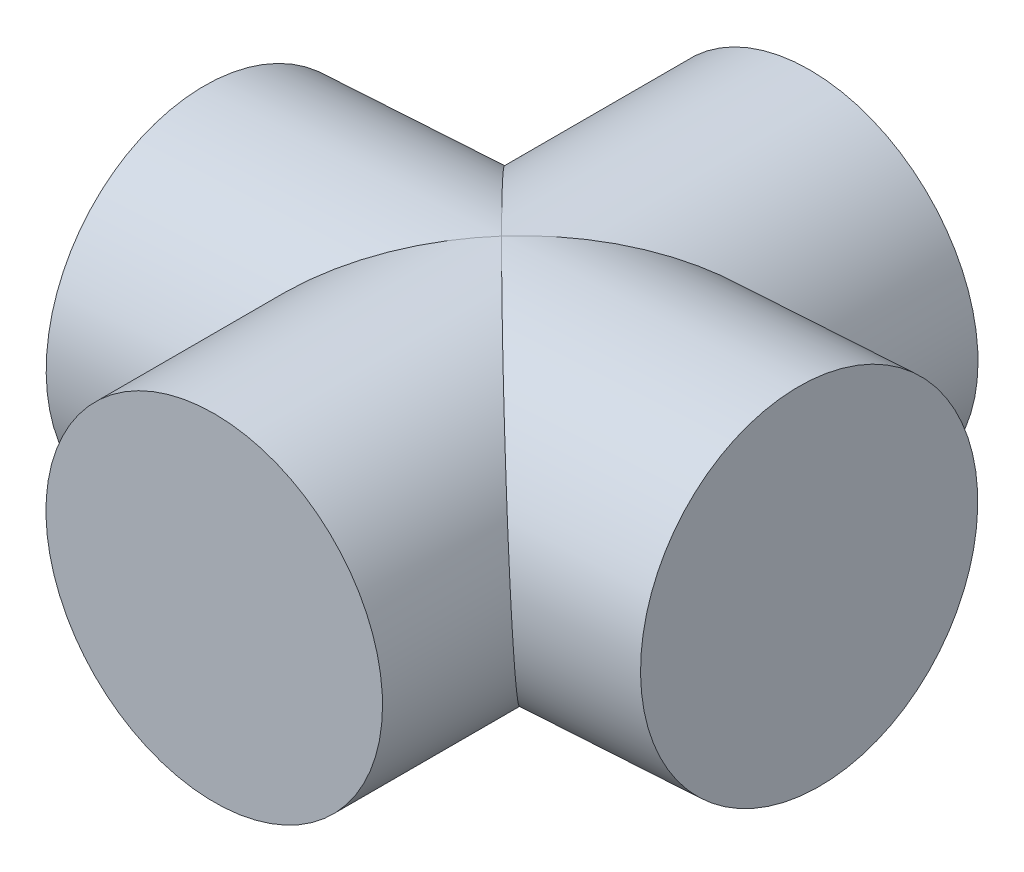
ISO-10303-21;
HEADER;
FILE_DESCRIPTION(('STEP AP214'),'2;1');
FILE_NAME('part.step','',(''),(''),'','','');
FILE_SCHEMA(('AUTOMOTIVE_DESIGN { 1 0 10303 214 1 1 1 1 }'));
ENDSEC;
DATA;
#1=APPLICATION_CONTEXT('core data for automotive mechanical design processes');
#2=APPLICATION_PROTOCOL_DEFINITION('international standard','automotive_design',2000,#1);
#3=PRODUCT_CONTEXT('',#1,'mechanical');
#4=PRODUCT('Part','Part','',(#3));
#5=PRODUCT_RELATED_PRODUCT_CATEGORY('part','',(#4));
#6=PRODUCT_DEFINITION_FORMATION('','',#4);
#7=PRODUCT_DEFINITION_CONTEXT('part definition',#1,'design');
#8=PRODUCT_DEFINITION('design','',#6,#7);
#9=PRODUCT_DEFINITION_SHAPE('','',#8);
#10=(LENGTH_UNIT() NAMED_UNIT(*) SI_UNIT(.MILLI.,.METRE.));
#11=(NAMED_UNIT(*) PLANE_ANGLE_UNIT() SI_UNIT($,.RADIAN.));
#12=(NAMED_UNIT(*) SI_UNIT($,.STERADIAN.) SOLID_ANGLE_UNIT());
#13=UNCERTAINTY_MEASURE_WITH_UNIT(LENGTH_MEASURE(1.E-05),#10,'distance_accuracy_value','');
#14=(GEOMETRIC_REPRESENTATION_CONTEXT(3) GLOBAL_UNCERTAINTY_ASSIGNED_CONTEXT((#13)) GLOBAL_UNIT_ASSIGNED_CONTEXT((#10,
#11,#12)) REPRESENTATION_CONTEXT('',''));
#15=CARTESIAN_POINT('',(0.,0.,0.));
#16=DIRECTION('',(0.,0.,1.));
#17=DIRECTION('',(1.,0.,0.));
#18=AXIS2_PLACEMENT_3D('',#15,#16,#17);
#19=CARTESIAN_POINT('',(-44.993112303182,-44.3,-62.6231110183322));
#20=DIRECTION('',(-7.07976677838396E-08,0.,0.999999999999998));
#21=DIRECTION('',(0.998097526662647,0.0616549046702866,7.06629771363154E-08));
#22=AXIS2_PLACEMENT_3D('',#19,#20,#21);
#23=CYLINDRICAL_SURFACE('',#22,6.5);
#24=DIRECTION('',(-7.07976677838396E-08,0.,0.999999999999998));
#25=VECTOR('',#24,1.);
#26=CARTESIAN_POINT('',(-38.5054783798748,-43.8992431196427,-62.6231105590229));
#27=LINE('',#26,#25);
#28=CARTESIAN_POINT('',(-38.5054783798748,-43.8992431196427,-62.6231105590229));
#29=VERTEX_POINT('',#28);
#30=CARTESIAN_POINT('',(-38.505478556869,-43.8992431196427,-60.1231105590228));
#31=VERTEX_POINT('',#30);
#32=EDGE_CURVE('E95',#29,#31,#27,.T.);
#33=ORIENTED_EDGE('',*,*,#32,.F.);
#34=ORIENTED_EDGE('',*,*,#32,.T.);
#35=CARTESIAN_POINT('',(-44.5923560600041,-50.7876339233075,-53.6231109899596));
#36=CARTESIAN_POINT('',(-40.7919878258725,-50.5528759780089,-57.4307225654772));
#37=CARTESIAN_POINT('',(-38.2707206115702,-47.6996110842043,-60.1231105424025));
#38=CARTESIAN_POINT('',(-38.505478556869,-43.8992431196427,-60.1231105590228));
#39=(BOUNDED_CURVE() B_SPLINE_CURVE(3,(#35,#36,#37,#38),.UNSPECIFIED.,.F.,
.F.) B_SPLINE_CURVE_WITH_KNOTS((4,4),(1.5707963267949,3.1415926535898),
.UNSPECIFIED.) CURVE() GEOMETRIC_REPRESENTATION_ITEM() RATIONAL_B_SPLINE_CURVE((1.,
0.804737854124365,0.804737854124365,1.)) REPRESENTATION_ITEM(''));
#40=CARTESIAN_POINT('',(-44.5923560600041,-50.7876339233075,-53.6231109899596));
#41=VERTEX_POINT('',#40);
#42=EDGE_CURVE('E87',#41,#31,#39,.T.);
#43=ORIENTED_EDGE('',*,*,#42,.F.);
#44=CARTESIAN_POINT('',(-51.4807464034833,-44.7007568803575,-60.1231114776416));
#45=CARTESIAN_POINT('',(-51.2459884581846,-48.5011248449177,-60.1231114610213));
#46=CARTESIAN_POINT('',(-48.3927237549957,-51.0223918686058,-57.4307231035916));
#47=CARTESIAN_POINT('',(-44.5923560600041,-50.7876339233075,-53.6231109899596));
#48=(BOUNDED_CURVE() B_SPLINE_CURVE(3,(#44,#45,#46,#47),.UNSPECIFIED.,.F.,
.F.) B_SPLINE_CURVE_WITH_KNOTS((4,4),(3.1415926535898,4.71238898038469),
.UNSPECIFIED.) CURVE() GEOMETRIC_REPRESENTATION_ITEM() RATIONAL_B_SPLINE_CURVE((1.,
0.804737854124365,0.804737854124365,1.)) REPRESENTATION_ITEM(''));
#49=CARTESIAN_POINT('',(-51.4807464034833,-44.7007568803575,-60.1231114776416));
#50=VERTEX_POINT('',#49);
#51=EDGE_CURVE('E66',#50,#41,#48,.T.);
#52=ORIENTED_EDGE('',*,*,#51,.F.);
#53=DIRECTION('',(-7.07976677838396E-08,0.,0.999999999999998));
#54=VECTOR('',#53,1.);
#55=CARTESIAN_POINT('',(-51.4807462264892,-44.7007568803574,-62.6231114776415));
#56=LINE('',#55,#54);
#57=CARTESIAN_POINT('',(-51.4807462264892,-44.7007568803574,-62.6231114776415));
#58=VERTEX_POINT('',#57);
#59=EDGE_CURVE('E101',#58,#50,#56,.T.);
#60=ORIENTED_EDGE('',*,*,#59,.F.);
#61=ORIENTED_EDGE('',*,*,#59,.T.);
#62=CARTESIAN_POINT('',(-45.3938698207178,-37.8123660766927,-53.6231110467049));
#63=CARTESIAN_POINT('',(-49.1942375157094,-38.0471240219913,-57.430723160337));
#64=CARTESIAN_POINT('',(-51.7155043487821,-40.9003889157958,-60.1231114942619));
#65=CARTESIAN_POINT('',(-51.4807464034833,-44.7007568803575,-60.1231114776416));
#66=(BOUNDED_CURVE() B_SPLINE_CURVE(3,(#62,#63,#64,#65),.UNSPECIFIED.,.F.,
.F.) B_SPLINE_CURVE_WITH_KNOTS((4,4),(1.5707963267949,3.1415926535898),
.UNSPECIFIED.) CURVE() GEOMETRIC_REPRESENTATION_ITEM() RATIONAL_B_SPLINE_CURVE((1.,
0.804737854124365,0.804737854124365,1.)) REPRESENTATION_ITEM(''));
#67=CARTESIAN_POINT('',(-45.3938698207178,-37.8123660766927,-53.6231110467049));
#68=VERTEX_POINT('',#67);
#69=EDGE_CURVE('E82',#68,#50,#66,.T.);
#70=ORIENTED_EDGE('',*,*,#69,.F.);
#71=CARTESIAN_POINT('',(-38.505478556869,-43.8992431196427,-60.1231105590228));
#72=CARTESIAN_POINT('',(-38.7402365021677,-40.0988751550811,-60.1231105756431));
#73=CARTESIAN_POINT('',(-41.5935015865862,-37.5776081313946,-57.4307226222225));
#74=CARTESIAN_POINT('',(-45.3938698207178,-37.8123660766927,-53.6231110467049));
#75=(BOUNDED_CURVE() B_SPLINE_CURVE(3,(#71,#72,#73,#74),.UNSPECIFIED.,.F.,
.F.) B_SPLINE_CURVE_WITH_KNOTS((4,4),(3.1415926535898,4.71238898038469),
.UNSPECIFIED.) CURVE() GEOMETRIC_REPRESENTATION_ITEM() RATIONAL_B_SPLINE_CURVE((1.,
0.804737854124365,0.804737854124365,1.)) REPRESENTATION_ITEM(''));
#76=EDGE_CURVE('E104',#31,#68,#75,.T.);
#77=ORIENTED_EDGE('',*,*,#76,.F.);
#78=EDGE_LOOP('',(#33,#34,#43,#52,#60,#61,#70,#77));
#79=FACE_BOUND('',#78,.T.);
#80=CARTESIAN_POINT('',(-44.9931121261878,-44.3000000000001,-65.1231110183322));
#81=DIRECTION('',(-7.07976677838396E-08,0.,0.999999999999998));
#82=DIRECTION('',(0.999972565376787,-0.00740732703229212,7.07957255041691E-08));
#83=AXIS2_PLACEMENT_3D('',#80,#81,#82);
#84=CIRCLE('',#83,6.5);
#85=CARTESIAN_POINT('',(-38.4932904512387,-44.34814762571,-65.12311055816));
#86=VERTEX_POINT('',#85);
#87=EDGE_CURVE('E110',#86,#86,#84,.T.);
#88=ORIENTED_EDGE('',*,*,#87,.T.);
#89=EDGE_LOOP('',(#88));
#90=FACE_BOUND('',#89,.T.);
#91=ADVANCED_FACE('F16',(#79,#90),#23,.T.);
#92=CARTESIAN_POINT('',(-36.0102352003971,-43.7451058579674,-53.6231103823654));
#93=DIRECTION('',(-0.998097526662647,-0.0616549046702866,-7.0662980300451E-08));
#94=DIRECTION('',(-7.07976713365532E-08,0.,0.999999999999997));
#95=AXIS2_PLACEMENT_3D('',#92,#93,#94);
#96=CYLINDRICAL_SURFACE('',#95,6.5);
#97=ORIENTED_EDGE('',*,*,#69,.T.);
#98=DIRECTION('',(-0.998097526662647,-0.0616549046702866,-7.0662980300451E-08));
#99=VECTOR('',#98,1.);
#100=CARTESIAN_POINT('',(-36.0102347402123,-43.7451058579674,-60.1231103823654));
#101=LINE('',#100,#99);
#102=CARTESIAN_POINT('',(-53.97599022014,-44.8548941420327,-60.123111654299));
#103=VERTEX_POINT('',#102);
#104=EDGE_CURVE('E20',#50,#103,#101,.T.);
#105=ORIENTED_EDGE('',*,*,#104,.T.);
#106=ORIENTED_EDGE('',*,*,#104,.F.);
#107=ORIENTED_EDGE('',*,*,#51,.T.);
#108=CARTESIAN_POINT('',(-44.5923560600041,-50.7876339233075,-53.6231109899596));
#109=CARTESIAN_POINT('',(-48.3927242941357,-51.0223918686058,-49.8154994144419));
#110=CARTESIAN_POINT('',(-51.2459893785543,-48.5011248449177,-47.1231114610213));
#111=CARTESIAN_POINT('',(-51.480747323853,-44.7007568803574,-47.1231114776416));
#112=(BOUNDED_CURVE() B_SPLINE_CURVE(3,(#108,#109,#110,#111),.UNSPECIFIED.,.F.,
.F.) B_SPLINE_CURVE_WITH_KNOTS((4,4),(4.71238898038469,6.28318530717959),
.UNSPECIFIED.) CURVE() GEOMETRIC_REPRESENTATION_ITEM() RATIONAL_B_SPLINE_CURVE((1.,
0.804737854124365,0.804737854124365,1.)) REPRESENTATION_ITEM(''));
#113=CARTESIAN_POINT('',(-51.480747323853,-44.7007568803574,-47.1231114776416));
#114=VERTEX_POINT('',#113);
#115=EDGE_CURVE('E27',#41,#114,#112,.T.);
#116=ORIENTED_EDGE('',*,*,#115,.T.);
#117=DIRECTION('',(-0.998097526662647,-0.0616549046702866,-7.0662980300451E-08));
#118=VECTOR('',#117,1.);
#119=CARTESIAN_POINT('',(-36.010235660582,-43.7451058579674,-47.1231103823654));
#120=LINE('',#119,#118);
#121=CARTESIAN_POINT('',(-53.9759911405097,-44.8548941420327,-47.1231116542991));
#122=VERTEX_POINT('',#121);
#123=EDGE_CURVE('E147',#114,#122,#120,.T.);
#124=ORIENTED_EDGE('',*,*,#123,.T.);
#125=ORIENTED_EDGE('',*,*,#123,.F.);
#126=CARTESIAN_POINT('',(-51.480747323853,-44.7007568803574,-47.1231114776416));
#127=CARTESIAN_POINT('',(-51.7155052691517,-40.9003889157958,-47.123111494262));
#128=CARTESIAN_POINT('',(-49.1942380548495,-38.0471240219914,-49.8154994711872));
#129=CARTESIAN_POINT('',(-45.3938698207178,-37.8123660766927,-53.6231110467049));
#130=(BOUNDED_CURVE() B_SPLINE_CURVE(3,(#126,#127,#128,#129),.UNSPECIFIED.,.F.,
.F.) B_SPLINE_CURVE_WITH_KNOTS((4,4),(0.,1.5707963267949),
.UNSPECIFIED.) CURVE() GEOMETRIC_REPRESENTATION_ITEM() RATIONAL_B_SPLINE_CURVE((1.,
0.804737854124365,0.804737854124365,1.)) REPRESENTATION_ITEM(''));
#131=EDGE_CURVE('E145',#114,#68,#130,.T.);
#132=ORIENTED_EDGE('',*,*,#131,.T.);
#133=EDGE_LOOP('',(#97,#105,#106,#107,#116,#124,#125,#132));
#134=FACE_BOUND('',#133,.T.);
#135=CARTESIAN_POINT('',(-56.4712344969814,-45.0090314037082,-53.6231118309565));
#136=DIRECTION('',(0.998097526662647,0.0616549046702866,7.0662980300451E-08));
#137=DIRECTION('',(7.07976713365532E-08,0.,-0.999999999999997));
#138=AXIS2_PLACEMENT_3D('',#135,#136,#137);
#139=CIRCLE('',#138,6.5);
#140=CARTESIAN_POINT('',(-56.4712340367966,-45.0090314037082,-60.1231118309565));
#141=VERTEX_POINT('',#140);
#142=EDGE_CURVE('E188',#141,#141,#139,.T.);
#143=ORIENTED_EDGE('',*,*,#142,.T.);
#144=EDGE_LOOP('',(#143));
#145=FACE_BOUND('',#144,.T.);
#146=ADVANCED_FACE('F18',(#134,#145),#96,.T.);
#147=CARTESIAN_POINT('',(-44.993112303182,-44.3,-62.6231110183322));
#148=DIRECTION('',(-7.07976677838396E-08,0.,0.999999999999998));
#149=DIRECTION('',(0.998097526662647,0.0616549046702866,7.06629771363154E-08));
#150=AXIS2_PLACEMENT_3D('',#147,#148,#149);
#151=CYLINDRICAL_SURFACE('',#150,6.5);
#152=ORIENTED_EDGE('',*,*,#131,.F.);
#153=DIRECTION('',(-7.07976677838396E-08,0.,0.999999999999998));
#154=VECTOR('',#153,1.);
#155=CARTESIAN_POINT('',(-51.4807462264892,-44.7007568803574,-62.6231114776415));
#156=LINE('',#155,#154);
#157=CARTESIAN_POINT('',(-51.4807475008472,-44.7007568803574,-44.6231114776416));
#158=VERTEX_POINT('',#157);
#159=EDGE_CURVE('E173',#114,#158,#156,.T.);
#160=ORIENTED_EDGE('',*,*,#159,.T.);
#161=ORIENTED_EDGE('',*,*,#159,.F.);
#162=ORIENTED_EDGE('',*,*,#115,.F.);
#163=CARTESIAN_POINT('',(-38.5054794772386,-43.8992431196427,-47.1231105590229));
#164=CARTESIAN_POINT('',(-38.2707215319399,-47.6996110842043,-47.1231105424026));
#165=CARTESIAN_POINT('',(-40.7919883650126,-50.5528759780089,-49.8154988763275));
#166=CARTESIAN_POINT('',(-44.5923560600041,-50.7876339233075,-53.6231109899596));
#167=(BOUNDED_CURVE() B_SPLINE_CURVE(3,(#163,#164,#165,#166),.UNSPECIFIED.,.F.,
.F.) B_SPLINE_CURVE_WITH_KNOTS((4,4),(0.,1.5707963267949),
.UNSPECIFIED.) CURVE() GEOMETRIC_REPRESENTATION_ITEM() RATIONAL_B_SPLINE_CURVE((1.,
0.804737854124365,0.804737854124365,1.)) REPRESENTATION_ITEM(''));
#168=CARTESIAN_POINT('',(-38.5054794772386,-43.8992431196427,-47.1231105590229));
#169=VERTEX_POINT('',#168);
#170=EDGE_CURVE('E10',#169,#41,#167,.T.);
#171=ORIENTED_EDGE('',*,*,#170,.F.);
#172=DIRECTION('',(-7.07976677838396E-08,0.,0.999999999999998));
#173=VECTOR('',#172,1.);
#174=CARTESIAN_POINT('',(-38.5054783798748,-43.8992431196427,-62.6231105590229));
#175=LINE('',#174,#173);
#176=CARTESIAN_POINT('',(-38.5054796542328,-43.8992431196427,-44.6231105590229));
#177=VERTEX_POINT('',#176);
#178=EDGE_CURVE('E56',#169,#177,#175,.T.);
#179=ORIENTED_EDGE('',*,*,#178,.T.);
#180=ORIENTED_EDGE('',*,*,#178,.F.);
#181=CARTESIAN_POINT('',(-45.3938698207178,-37.8123660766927,-53.6231110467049));
#182=CARTESIAN_POINT('',(-41.5935021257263,-37.5776081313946,-49.8154989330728));
#183=CARTESIAN_POINT('',(-38.7402374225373,-40.0988751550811,-47.1231105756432));
#184=CARTESIAN_POINT('',(-38.5054794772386,-43.8992431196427,-47.1231105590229));
#185=(BOUNDED_CURVE() B_SPLINE_CURVE(3,(#181,#182,#183,#184),.UNSPECIFIED.,.F.,
.F.) B_SPLINE_CURVE_WITH_KNOTS((4,4),(4.71238898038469,6.28318530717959),
.UNSPECIFIED.) CURVE() GEOMETRIC_REPRESENTATION_ITEM() RATIONAL_B_SPLINE_CURVE((1.,
0.804737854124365,0.804737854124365,1.)) REPRESENTATION_ITEM(''));
#186=EDGE_CURVE('E107',#68,#169,#185,.T.);
#187=ORIENTED_EDGE('',*,*,#186,.F.);
#188=EDGE_LOOP('',(#152,#160,#161,#162,#171,#179,#180,#187));
#189=FACE_BOUND('',#188,.T.);
#190=CARTESIAN_POINT('',(-44.9931137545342,-44.3,-42.1231110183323));
#191=DIRECTION('',(-7.07976677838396E-08,0.,0.999999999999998));
#192=DIRECTION('',(0.999972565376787,-0.00740732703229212,7.07957255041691E-08));
#193=AXIS2_PLACEMENT_3D('',#190,#191,#192);
#194=CIRCLE('',#193,6.5);
#195=CARTESIAN_POINT('',(-38.4932920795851,-44.3481476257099,-42.12311055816));
#196=VERTEX_POINT('',#195);
#197=EDGE_CURVE('E115',#196,#196,#194,.T.);
#198=ORIENTED_EDGE('',*,*,#197,.F.);
#199=EDGE_LOOP('',(#198));
#200=FACE_BOUND('',#199,.T.);
#201=ADVANCED_FACE('F198',(#189,#200),#151,.T.);
#202=CARTESIAN_POINT('',(-36.0102352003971,-43.7451058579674,-53.6231103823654));
#203=DIRECTION('',(-0.998097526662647,-0.0616549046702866,-7.0662980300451E-08));
#204=DIRECTION('',(-7.07976713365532E-08,0.,0.999999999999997));
#205=AXIS2_PLACEMENT_3D('',#202,#203,#204);
#206=CYLINDRICAL_SURFACE('',#205,6.5);
#207=DIRECTION('',(-0.998097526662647,-0.0616549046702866,-7.0662980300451E-08));
#208=VECTOR('',#207,1.);
#209=CARTESIAN_POINT('',(-36.010235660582,-43.7451058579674,-47.1231103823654));
#210=LINE('',#209,#208);
#211=CARTESIAN_POINT('',(-36.010235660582,-43.7451058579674,-47.1231103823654));
#212=VERTEX_POINT('',#211);
#213=EDGE_CURVE('E141',#212,#169,#210,.T.);
#214=ORIENTED_EDGE('',*,*,#213,.F.);
#215=ORIENTED_EDGE('',*,*,#213,.T.);
#216=ORIENTED_EDGE('',*,*,#170,.T.);
#217=ORIENTED_EDGE('',*,*,#42,.T.);
#218=DIRECTION('',(-0.998097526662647,-0.0616549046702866,-7.0662980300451E-08));
#219=VECTOR('',#218,1.);
#220=CARTESIAN_POINT('',(-36.0102347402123,-43.7451058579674,-60.1231103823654));
#221=LINE('',#220,#219);
#222=CARTESIAN_POINT('',(-36.0102347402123,-43.7451058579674,-60.1231103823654));
#223=VERTEX_POINT('',#222);
#224=EDGE_CURVE('E93',#223,#31,#221,.T.);
#225=ORIENTED_EDGE('',*,*,#224,.F.);
#226=ORIENTED_EDGE('',*,*,#224,.T.);
#227=ORIENTED_EDGE('',*,*,#76,.T.);
#228=ORIENTED_EDGE('',*,*,#186,.T.);
#229=EDGE_LOOP('',(#214,#215,#216,#217,#225,#226,#227,#228));
#230=FACE_BOUND('',#229,.T.);
#231=CARTESIAN_POINT('',(-33.5149913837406,-43.5909685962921,-53.6231102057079));
#232=DIRECTION('',(0.998097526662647,0.0616549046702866,7.0662980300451E-08));
#233=DIRECTION('',(7.07976713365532E-08,0.,-0.999999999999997));
#234=AXIS2_PLACEMENT_3D('',#231,#232,#233);
#235=CIRCLE('',#234,6.5);
#236=CARTESIAN_POINT('',(-33.5149909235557,-43.5909685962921,-60.1231102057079));
#237=VERTEX_POINT('',#236);
#238=EDGE_CURVE('E191',#237,#237,#235,.T.);
#239=ORIENTED_EDGE('',*,*,#238,.F.);
#240=EDGE_LOOP('',(#239));
#241=FACE_BOUND('',#240,.T.);
#242=ADVANCED_FACE('F89',(#230,#241),#206,.T.);
#243=CARTESIAN_POINT('',(-44.9931121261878,-44.3000000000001,-65.1231110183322));
#244=DIRECTION('',(-7.07976677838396E-08,0.,0.999999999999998));
#245=DIRECTION('',(0.999972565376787,-0.00740732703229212,7.07957255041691E-08));
#246=AXIS2_PLACEMENT_3D('',#243,#244,#245);
#247=PLANE('',#246);
#248=ORIENTED_EDGE('',*,*,#87,.F.);
#249=EDGE_LOOP('',(#248));
#250=FACE_BOUND('',#249,.T.);
#251=ADVANCED_FACE('F197',(#250),#247,.F.);
#252=CARTESIAN_POINT('',(-44.9931137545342,-44.3,-42.1231110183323));
#253=DIRECTION('',(-7.07976677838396E-08,0.,0.999999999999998));
#254=DIRECTION('',(0.999972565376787,-0.00740732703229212,7.07957255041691E-08));
#255=AXIS2_PLACEMENT_3D('',#252,#253,#254);
#256=PLANE('',#255);
#257=ORIENTED_EDGE('',*,*,#197,.T.);
#258=EDGE_LOOP('',(#257));
#259=FACE_BOUND('',#258,.T.);
#260=ADVANCED_FACE('F204',(#259),#256,.T.);
#261=CARTESIAN_POINT('',(-56.4712344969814,-45.0090314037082,-53.6231118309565));
#262=DIRECTION('',(0.998097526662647,0.0616549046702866,7.0662980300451E-08));
#263=DIRECTION('',(7.07976713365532E-08,0.,-0.999999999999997));
#264=AXIS2_PLACEMENT_3D('',#261,#262,#263);
#265=PLANE('',#264);
#266=ORIENTED_EDGE('',*,*,#142,.F.);
#267=EDGE_LOOP('',(#266));
#268=FACE_BOUND('',#267,.T.);
#269=ADVANCED_FACE('F216',(#268),#265,.F.);
#270=CARTESIAN_POINT('',(-33.5149913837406,-43.5909685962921,-53.6231102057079));
#271=DIRECTION('',(0.998097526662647,0.0616549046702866,7.0662980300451E-08));
#272=DIRECTION('',(7.07976713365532E-08,0.,-0.999999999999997));
#273=AXIS2_PLACEMENT_3D('',#270,#271,#272);
#274=PLANE('',#273);
#275=ORIENTED_EDGE('',*,*,#238,.T.);
#276=EDGE_LOOP('',(#275));
#277=FACE_BOUND('',#276,.T.);
#278=ADVANCED_FACE('F195',(#277),#274,.T.);
#279=CLOSED_SHELL('',(#91,#146,#201,#242,#251,#260,#269,#278));
#280=MANIFOLD_SOLID_BREP('B1',#279);
#281=ADVANCED_BREP_SHAPE_REPRESENTATION('',(#18,#280),#14);
#282=SHAPE_DEFINITION_REPRESENTATION(#9,#281);
ENDSEC;
END-ISO-10303-21;
